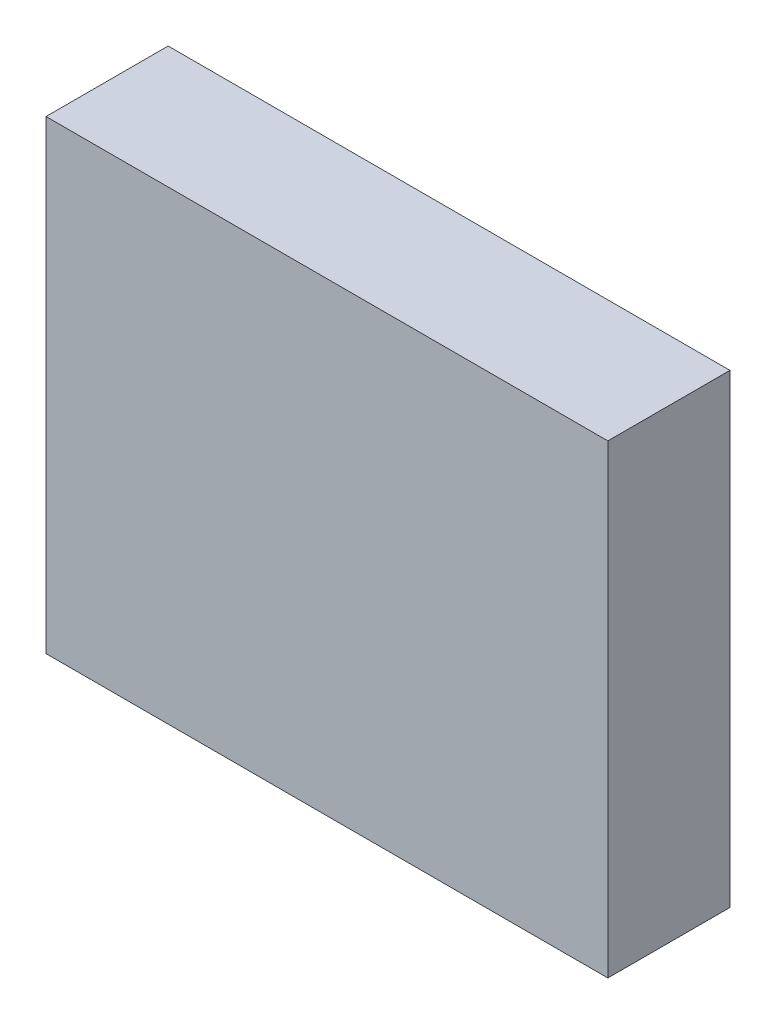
ISO-10303-21;
HEADER;
FILE_DESCRIPTION(('STEP AP214'),'2;1');
FILE_NAME('part.step','',(''),(''),'','','');
FILE_SCHEMA(('AUTOMOTIVE_DESIGN { 1 0 10303 214 1 1 1 1 }'));
ENDSEC;
DATA;
#1=APPLICATION_CONTEXT('core data for automotive mechanical design processes');
#2=APPLICATION_PROTOCOL_DEFINITION('international standard','automotive_design',2000,#1);
#3=PRODUCT_CONTEXT('',#1,'mechanical');
#4=PRODUCT('Part','Part','',(#3));
#5=PRODUCT_RELATED_PRODUCT_CATEGORY('part','',(#4));
#6=PRODUCT_DEFINITION_FORMATION('','',#4);
#7=PRODUCT_DEFINITION_CONTEXT('part definition',#1,'design');
#8=PRODUCT_DEFINITION('design','',#6,#7);
#9=PRODUCT_DEFINITION_SHAPE('','',#8);
#10=(LENGTH_UNIT() NAMED_UNIT(*) SI_UNIT(.MILLI.,.METRE.));
#11=(NAMED_UNIT(*) PLANE_ANGLE_UNIT() SI_UNIT($,.RADIAN.));
#12=(NAMED_UNIT(*) SI_UNIT($,.STERADIAN.) SOLID_ANGLE_UNIT());
#13=UNCERTAINTY_MEASURE_WITH_UNIT(LENGTH_MEASURE(1.E-05),#10,'distance_accuracy_value','');
#14=(GEOMETRIC_REPRESENTATION_CONTEXT(3) GLOBAL_UNCERTAINTY_ASSIGNED_CONTEXT((#13)) GLOBAL_UNIT_ASSIGNED_CONTEXT((#10,
#11,#12)) REPRESENTATION_CONTEXT('',''));
#15=CARTESIAN_POINT('',(0.,0.,0.));
#16=DIRECTION('',(0.,0.,1.));
#17=DIRECTION('',(1.,0.,0.));
#18=AXIS2_PLACEMENT_3D('',#15,#16,#17);
#19=CARTESIAN_POINT('',(0.,0.,10.));
#20=DIRECTION('',(1.,0.,0.));
#21=DIRECTION('',(0.,0.,-1.));
#22=AXIS2_PLACEMENT_3D('',#19,#20,#21);
#23=PLANE('',#22);
#24=DIRECTION('',(0.,-1.,0.));
#25=VECTOR('',#24,1.);
#26=CARTESIAN_POINT('',(0.,0.,-10.));
#27=LINE('',#26,#25);
#28=CARTESIAN_POINT('',(0.,76.1808157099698,-10.));
#29=VERTEX_POINT('',#28);
#30=CARTESIAN_POINT('',(0.,0.,-10.));
#31=VERTEX_POINT('',#30);
#32=EDGE_CURVE('E94',#29,#31,#27,.T.);
#33=ORIENTED_EDGE('',*,*,#32,.T.);
#34=DIRECTION('',(0.,0.,-1.));
#35=VECTOR('',#34,1.);
#36=CARTESIAN_POINT('',(0.,0.,10.));
#37=LINE('',#36,#35);
#38=CARTESIAN_POINT('',(0.,0.,10.));
#39=VERTEX_POINT('',#38);
#40=EDGE_CURVE('E11',#39,#31,#37,.T.);
#41=ORIENTED_EDGE('',*,*,#40,.F.);
#42=DIRECTION('',(0.,-1.,0.));
#43=VECTOR('',#42,1.);
#44=CARTESIAN_POINT('',(0.,0.,10.));
#45=LINE('',#44,#43);
#46=CARTESIAN_POINT('',(0.,76.1808157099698,10.));
#47=VERTEX_POINT('',#46);
#48=EDGE_CURVE('E82',#47,#39,#45,.T.);
#49=ORIENTED_EDGE('',*,*,#48,.F.);
#50=DIRECTION('',(0.,0.,-1.));
#51=VECTOR('',#50,1.);
#52=CARTESIAN_POINT('',(0.,76.1808157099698,10.));
#53=LINE('',#52,#51);
#54=EDGE_CURVE('E90',#47,#29,#53,.T.);
#55=ORIENTED_EDGE('',*,*,#54,.T.);
#56=EDGE_LOOP('',(#33,#41,#49,#55));
#57=FACE_BOUND('',#56,.T.);
#58=ADVANCED_FACE('F31',(#57),#23,.F.);
#59=CARTESIAN_POINT('',(0.,0.,10.));
#60=DIRECTION('',(0.,1.,0.));
#61=DIRECTION('',(0.,0.,1.));
#62=AXIS2_PLACEMENT_3D('',#59,#60,#61);
#63=PLANE('',#62);
#64=DIRECTION('',(1.,0.,0.));
#65=VECTOR('',#64,1.);
#66=CARTESIAN_POINT('',(0.,0.,-10.));
#67=LINE('',#66,#65);
#68=CARTESIAN_POINT('',(92.0078549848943,0.,-10.));
#69=VERTEX_POINT('',#68);
#70=EDGE_CURVE('E86',#31,#69,#67,.T.);
#71=ORIENTED_EDGE('',*,*,#70,.T.);
#72=DIRECTION('',(0.,0.,-1.));
#73=VECTOR('',#72,1.);
#74=CARTESIAN_POINT('',(92.0078549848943,0.,10.));
#75=LINE('',#74,#73);
#76=CARTESIAN_POINT('',(92.0078549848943,0.,10.));
#77=VERTEX_POINT('',#76);
#78=EDGE_CURVE('E39',#77,#69,#75,.T.);
#79=ORIENTED_EDGE('',*,*,#78,.F.);
#80=DIRECTION('',(1.,0.,0.));
#81=VECTOR('',#80,1.);
#82=CARTESIAN_POINT('',(0.,0.,10.));
#83=LINE('',#82,#81);
#84=EDGE_CURVE('E77',#39,#77,#83,.T.);
#85=ORIENTED_EDGE('',*,*,#84,.F.);
#86=ORIENTED_EDGE('',*,*,#40,.T.);
#87=EDGE_LOOP('',(#71,#79,#85,#86));
#88=FACE_BOUND('',#87,.T.);
#89=ADVANCED_FACE('F85',(#88),#63,.F.);
#90=CARTESIAN_POINT('',(92.0078549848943,0.,10.));
#91=DIRECTION('',(-1.,0.,0.));
#92=DIRECTION('',(0.,0.,1.));
#93=AXIS2_PLACEMENT_3D('',#90,#91,#92);
#94=PLANE('',#93);
#95=DIRECTION('',(0.,1.,0.));
#96=VECTOR('',#95,1.);
#97=CARTESIAN_POINT('',(92.0078549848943,0.,-10.));
#98=LINE('',#97,#96);
#99=CARTESIAN_POINT('',(92.0078549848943,76.1808157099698,-10.));
#100=VERTEX_POINT('',#99);
#101=EDGE_CURVE('E64',#69,#100,#98,.T.);
#102=ORIENTED_EDGE('',*,*,#101,.T.);
#103=DIRECTION('',(0.,0.,-1.));
#104=VECTOR('',#103,1.);
#105=CARTESIAN_POINT('',(92.0078549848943,76.1808157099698,10.));
#106=LINE('',#105,#104);
#107=CARTESIAN_POINT('',(92.0078549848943,76.1808157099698,10.));
#108=VERTEX_POINT('',#107);
#109=EDGE_CURVE('E87',#108,#100,#106,.T.);
#110=ORIENTED_EDGE('',*,*,#109,.F.);
#111=DIRECTION('',(0.,1.,0.));
#112=VECTOR('',#111,1.);
#113=CARTESIAN_POINT('',(92.0078549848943,0.,10.));
#114=LINE('',#113,#112);
#115=EDGE_CURVE('E80',#77,#108,#114,.T.);
#116=ORIENTED_EDGE('',*,*,#115,.F.);
#117=ORIENTED_EDGE('',*,*,#78,.T.);
#118=EDGE_LOOP('',(#102,#110,#116,#117));
#119=FACE_BOUND('',#118,.T.);
#120=ADVANCED_FACE('F88',(#119),#94,.F.);
#121=CARTESIAN_POINT('',(0.,76.1808157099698,10.));
#122=DIRECTION('',(0.,-1.,0.));
#123=DIRECTION('',(0.,0.,-1.));
#124=AXIS2_PLACEMENT_3D('',#121,#122,#123);
#125=PLANE('',#124);
#126=DIRECTION('',(-1.,0.,0.));
#127=VECTOR('',#126,1.);
#128=CARTESIAN_POINT('',(0.,76.1808157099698,-10.));
#129=LINE('',#128,#127);
#130=EDGE_CURVE('E70',#100,#29,#129,.T.);
#131=ORIENTED_EDGE('',*,*,#130,.T.);
#132=ORIENTED_EDGE('',*,*,#54,.F.);
#133=DIRECTION('',(-1.,0.,0.));
#134=VECTOR('',#133,1.);
#135=CARTESIAN_POINT('',(0.,76.1808157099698,10.));
#136=LINE('',#135,#134);
#137=EDGE_CURVE('E47',#108,#47,#136,.T.);
#138=ORIENTED_EDGE('',*,*,#137,.F.);
#139=ORIENTED_EDGE('',*,*,#109,.T.);
#140=EDGE_LOOP('',(#131,#132,#138,#139));
#141=FACE_BOUND('',#140,.T.);
#142=ADVANCED_FACE('F101',(#141),#125,.F.);
#143=CARTESIAN_POINT('',(0.,76.1808157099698,10.));
#144=DIRECTION('',(0.,0.,-1.));
#145=DIRECTION('',(-1.,0.,0.));
#146=AXIS2_PLACEMENT_3D('',#143,#144,#145);
#147=PLANE('',#146);
#148=ORIENTED_EDGE('',*,*,#48,.T.);
#149=ORIENTED_EDGE('',*,*,#84,.T.);
#150=ORIENTED_EDGE('',*,*,#115,.T.);
#151=ORIENTED_EDGE('',*,*,#137,.T.);
#152=EDGE_LOOP('',(#148,#149,#150,#151));
#153=FACE_BOUND('',#152,.T.);
#154=ADVANCED_FACE('F78',(#153),#147,.F.);
#155=CARTESIAN_POINT('',(0.,76.1808157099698,-10.));
#156=DIRECTION('',(0.,0.,-1.));
#157=DIRECTION('',(-1.,0.,0.));
#158=AXIS2_PLACEMENT_3D('',#155,#156,#157);
#159=PLANE('',#158);
#160=ORIENTED_EDGE('',*,*,#32,.F.);
#161=ORIENTED_EDGE('',*,*,#130,.F.);
#162=ORIENTED_EDGE('',*,*,#101,.F.);
#163=ORIENTED_EDGE('',*,*,#70,.F.);
#164=EDGE_LOOP('',(#160,#161,#162,#163));
#165=FACE_BOUND('',#164,.T.);
#166=ADVANCED_FACE('F104',(#165),#159,.T.);
#167=CLOSED_SHELL('',(#58,#89,#120,#142,#154,#166));
#168=MANIFOLD_SOLID_BREP('B2',#167);
#169=ADVANCED_BREP_SHAPE_REPRESENTATION('',(#18,#168),#14);
#170=SHAPE_DEFINITION_REPRESENTATION(#9,#169);
ENDSEC;
END-ISO-10303-21;
